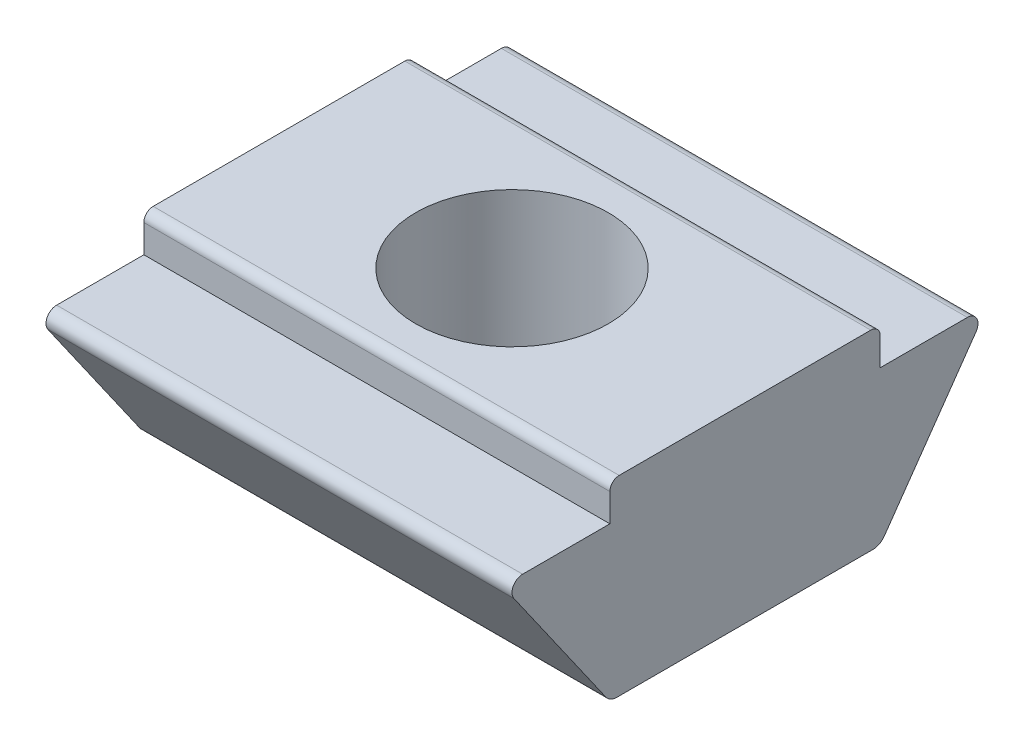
from build123d import *

# Parameters (mm, degrees)
BOSS_EXTRUDE1_DEPTH = 5
FILLET1_R           = 0.2
FILLET2_R           = 0.3
TAP1_D              = 4.134


with BuildPart() as part:
    # Sketch1 → Boss-Extrude1 (new, symmetric)
    with BuildSketch(Plane(origin=(0, 0, 0), x_dir=(0, 0, -1), z_dir=(1, 0, 0))):
        with BuildLine():
            Line((2.9, -3.3), (-2.9, -3.3))
            Line((-2.9, -3.3), (-4.958787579, -0.358745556))
            ThreePointArc((-4.958787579, -0.358745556), (-4.974230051, -0.122705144), (-4.772, 0))
            Line((-4.772, 0), (-2.9, 0))
            Line((-2.9, 0), (-2.9, 0.8))
            Line((-2.9, 0.8), (2.9, 0.8))
            Line((2.9, 0.8), (2.9, 0))
            Line((2.9, 0), (4.772, 0))
            ThreePointArc((4.772, 0), (4.974230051, -0.122705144), (4.958787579, -0.358745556))
            Line((4.958787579, -0.358745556), (2.9, -3.3))
        make_face()
    extrude(amount=BOSS_EXTRUDE1_DEPTH, both=True)

    # Fillet1
    fillet1_edges = [part.edges().sort_by_distance(p)[0] for p in [
        (0, 0.8, 2.9),
        (0, 0.8, -2.9),
    ]]
    fillet(fillet1_edges, radius=FILLET1_R)

    # Fillet2
    fillet2_edges = [part.edges().sort_by_distance(p)[0] for p in [
        (0, -3.3, -2.9),
        (0, -3.3, 2.9),
    ]]
    fillet(fillet2_edges, radius=FILLET2_R)

    # Tap1 (through all)
    with Locations(Plane(origin=(0, 0.8, 0), x_dir=(1, 0, 0), z_dir=(0, 1, 0))):
        with Locations((0, 0)):
            Hole(TAP1_D / 2)


solid = part.part
